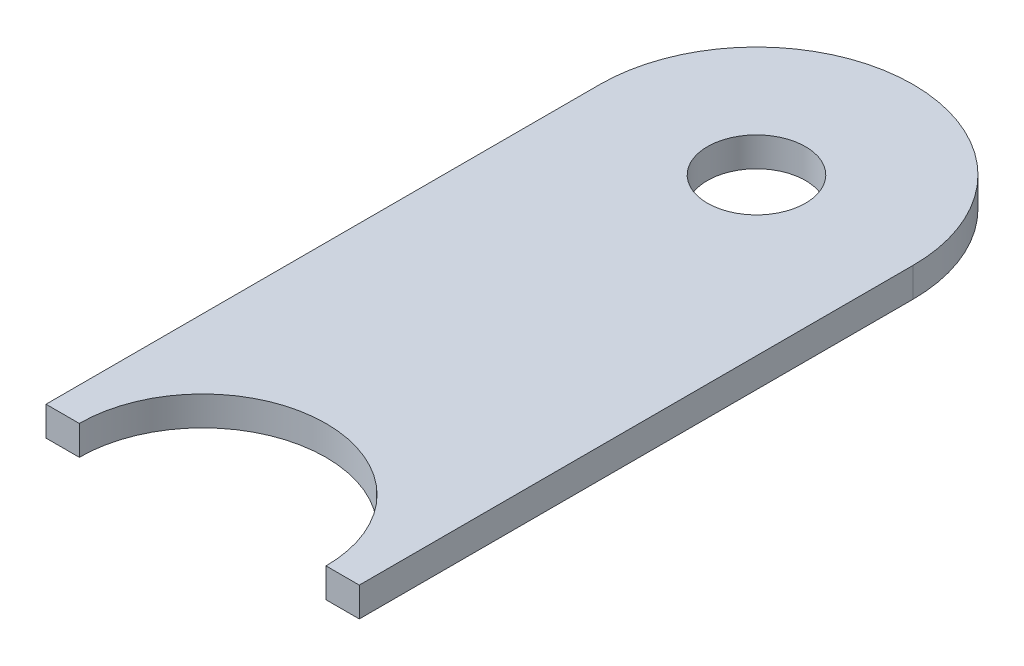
ISO-10303-21;
HEADER;
FILE_DESCRIPTION(('STEP AP214'),'2;1');
FILE_NAME('part.step','',(''),(''),'','','');
FILE_SCHEMA(('AUTOMOTIVE_DESIGN { 1 0 10303 214 1 1 1 1 }'));
ENDSEC;
DATA;
#1=APPLICATION_CONTEXT('core data for automotive mechanical design processes');
#2=APPLICATION_PROTOCOL_DEFINITION('international standard','automotive_design',2000,#1);
#3=PRODUCT_CONTEXT('',#1,'mechanical');
#4=PRODUCT('Part','Part','',(#3));
#5=PRODUCT_RELATED_PRODUCT_CATEGORY('part','',(#4));
#6=PRODUCT_DEFINITION_FORMATION('','',#4);
#7=PRODUCT_DEFINITION_CONTEXT('part definition',#1,'design');
#8=PRODUCT_DEFINITION('design','',#6,#7);
#9=PRODUCT_DEFINITION_SHAPE('','',#8);
#10=(LENGTH_UNIT() NAMED_UNIT(*) SI_UNIT(.MILLI.,.METRE.));
#11=(NAMED_UNIT(*) PLANE_ANGLE_UNIT() SI_UNIT($,.RADIAN.));
#12=(NAMED_UNIT(*) SI_UNIT($,.STERADIAN.) SOLID_ANGLE_UNIT());
#13=UNCERTAINTY_MEASURE_WITH_UNIT(LENGTH_MEASURE(1.E-05),#10,'distance_accuracy_value','');
#14=(GEOMETRIC_REPRESENTATION_CONTEXT(3) GLOBAL_UNCERTAINTY_ASSIGNED_CONTEXT((#13)) GLOBAL_UNIT_ASSIGNED_CONTEXT((#10,
#11,#12)) REPRESENTATION_CONTEXT('',''));
#15=CARTESIAN_POINT('',(0.,0.,0.));
#16=DIRECTION('',(0.,0.,1.));
#17=DIRECTION('',(1.,0.,0.));
#18=AXIS2_PLACEMENT_3D('',#15,#16,#17);
#19=CARTESIAN_POINT('',(16.,3.,0.));
#20=DIRECTION('',(0.,1.,0.));
#21=DIRECTION('',(0.,0.,1.));
#22=AXIS2_PLACEMENT_3D('',#19,#20,#21);
#23=PLANE('',#22);
#24=DIRECTION('',(1.,0.,0.));
#25=VECTOR('',#24,1.);
#26=CARTESIAN_POINT('',(0.,3.,0.));
#27=LINE('',#26,#25);
#28=CARTESIAN_POINT('',(0.,3.,0.));
#29=VERTEX_POINT('',#28);
#30=CARTESIAN_POINT('',(3.4,3.,0.));
#31=VERTEX_POINT('',#30);
#32=EDGE_CURVE('E152',#29,#31,#27,.T.);
#33=ORIENTED_EDGE('',*,*,#32,.T.);
#34=CARTESIAN_POINT('',(16.,3.,0.));
#35=DIRECTION('',(0.,-1.,0.));
#36=DIRECTION('',(0.,0.,1.));
#37=AXIS2_PLACEMENT_3D('',#34,#35,#36);
#38=CIRCLE('',#37,12.6);
#39=CARTESIAN_POINT('',(28.6,3.,0.));
#40=VERTEX_POINT('',#39);
#41=EDGE_CURVE('E100',#31,#40,#38,.T.);
#42=ORIENTED_EDGE('',*,*,#41,.T.);
#43=DIRECTION('',(1.,0.,0.));
#44=VECTOR('',#43,1.);
#45=CARTESIAN_POINT('',(28.6,3.,0.));
#46=LINE('',#45,#44);
#47=CARTESIAN_POINT('',(32.,3.,0.));
#48=VERTEX_POINT('',#47);
#49=EDGE_CURVE('E113',#40,#48,#46,.T.);
#50=ORIENTED_EDGE('',*,*,#49,.T.);
#51=DIRECTION('',(0.,0.,-1.));
#52=VECTOR('',#51,1.);
#53=CARTESIAN_POINT('',(32.,3.,0.));
#54=LINE('',#53,#52);
#55=CARTESIAN_POINT('',(32.,3.,-56.57));
#56=VERTEX_POINT('',#55);
#57=EDGE_CURVE('E107',#48,#56,#54,.T.);
#58=ORIENTED_EDGE('',*,*,#57,.T.);
#59=CARTESIAN_POINT('',(16.,3.,-56.57));
#60=DIRECTION('',(0.,1.,0.));
#61=DIRECTION('',(0.,0.,1.));
#62=AXIS2_PLACEMENT_3D('',#59,#60,#61);
#63=CIRCLE('',#62,16.);
#64=CARTESIAN_POINT('',(0.,3.,-56.57));
#65=VERTEX_POINT('',#64);
#66=EDGE_CURVE('E111',#56,#65,#63,.T.);
#67=ORIENTED_EDGE('',*,*,#66,.T.);
#68=DIRECTION('',(0.,0.,1.));
#69=VECTOR('',#68,1.);
#70=CARTESIAN_POINT('',(0.,3.,0.));
#71=LINE('',#70,#69);
#72=EDGE_CURVE('E63',#65,#29,#71,.T.);
#73=ORIENTED_EDGE('',*,*,#72,.T.);
#74=EDGE_LOOP('',(#33,#42,#50,#58,#67,#73));
#75=FACE_BOUND('',#74,.T.);
#76=CARTESIAN_POINT('',(16.,3.,-56.57));
#77=DIRECTION('',(0.,1.,0.));
#78=DIRECTION('',(0.,0.,1.));
#79=AXIS2_PLACEMENT_3D('',#76,#77,#78);
#80=CIRCLE('',#79,5.00842417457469);
#81=CARTESIAN_POINT('',(16.,3.,-51.5615758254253));
#82=VERTEX_POINT('',#81);
#83=EDGE_CURVE('E140',#82,#82,#80,.T.);
#84=ORIENTED_EDGE('',*,*,#83,.F.);
#85=EDGE_LOOP('',(#84));
#86=FACE_BOUND('',#85,.T.);
#87=ADVANCED_FACE('F45',(#75,#86),#23,.T.);
#88=CARTESIAN_POINT('',(16.,0.,0.));
#89=DIRECTION('',(0.,1.,0.));
#90=DIRECTION('',(0.,0.,1.));
#91=AXIS2_PLACEMENT_3D('',#88,#89,#90);
#92=PLANE('',#91);
#93=DIRECTION('',(1.,0.,0.));
#94=VECTOR('',#93,1.);
#95=CARTESIAN_POINT('',(0.,0.,0.));
#96=LINE('',#95,#94);
#97=CARTESIAN_POINT('',(0.,0.,0.));
#98=VERTEX_POINT('',#97);
#99=CARTESIAN_POINT('',(3.4,0.,0.));
#100=VERTEX_POINT('',#99);
#101=EDGE_CURVE('E135',#98,#100,#96,.T.);
#102=ORIENTED_EDGE('',*,*,#101,.F.);
#103=DIRECTION('',(0.,0.,1.));
#104=VECTOR('',#103,1.);
#105=CARTESIAN_POINT('',(0.,0.,0.));
#106=LINE('',#105,#104);
#107=CARTESIAN_POINT('',(0.,0.,-56.57));
#108=VERTEX_POINT('',#107);
#109=EDGE_CURVE('E92',#108,#98,#106,.T.);
#110=ORIENTED_EDGE('',*,*,#109,.F.);
#111=CARTESIAN_POINT('',(16.,0.,-56.57));
#112=DIRECTION('',(0.,1.,0.));
#113=DIRECTION('',(0.,0.,1.));
#114=AXIS2_PLACEMENT_3D('',#111,#112,#113);
#115=CIRCLE('',#114,16.);
#116=CARTESIAN_POINT('',(32.,0.,-56.57));
#117=VERTEX_POINT('',#116);
#118=EDGE_CURVE('E86',#117,#108,#115,.T.);
#119=ORIENTED_EDGE('',*,*,#118,.F.);
#120=DIRECTION('',(0.,0.,-1.));
#121=VECTOR('',#120,1.);
#122=CARTESIAN_POINT('',(32.,0.,0.));
#123=LINE('',#122,#121);
#124=CARTESIAN_POINT('',(32.,0.,0.));
#125=VERTEX_POINT('',#124);
#126=EDGE_CURVE('E122',#125,#117,#123,.T.);
#127=ORIENTED_EDGE('',*,*,#126,.F.);
#128=DIRECTION('',(1.,0.,0.));
#129=VECTOR('',#128,1.);
#130=CARTESIAN_POINT('',(28.6,0.,0.));
#131=LINE('',#130,#129);
#132=CARTESIAN_POINT('',(28.6,0.,0.));
#133=VERTEX_POINT('',#132);
#134=EDGE_CURVE('E143',#133,#125,#131,.T.);
#135=ORIENTED_EDGE('',*,*,#134,.F.);
#136=CARTESIAN_POINT('',(16.,0.,0.));
#137=DIRECTION('',(0.,-1.,0.));
#138=DIRECTION('',(0.,0.,1.));
#139=AXIS2_PLACEMENT_3D('',#136,#137,#138);
#140=CIRCLE('',#139,12.6);
#141=EDGE_CURVE('E139',#100,#133,#140,.T.);
#142=ORIENTED_EDGE('',*,*,#141,.F.);
#143=EDGE_LOOP('',(#102,#110,#119,#127,#135,#142));
#144=FACE_BOUND('',#143,.T.);
#145=CARTESIAN_POINT('',(16.,0.,-56.57));
#146=DIRECTION('',(0.,1.,0.));
#147=DIRECTION('',(0.,0.,1.));
#148=AXIS2_PLACEMENT_3D('',#145,#146,#147);
#149=CIRCLE('',#148,5.00842417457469);
#150=CARTESIAN_POINT('',(16.,0.,-51.5615758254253));
#151=VERTEX_POINT('',#150);
#152=EDGE_CURVE('E249',#151,#151,#149,.T.);
#153=ORIENTED_EDGE('',*,*,#152,.T.);
#154=EDGE_LOOP('',(#153));
#155=FACE_BOUND('',#154,.T.);
#156=ADVANCED_FACE('F165',(#144,#155),#92,.F.);
#157=CARTESIAN_POINT('',(0.,3.,0.));
#158=DIRECTION('',(0.,0.,-1.));
#159=DIRECTION('',(-1.,0.,0.));
#160=AXIS2_PLACEMENT_3D('',#157,#158,#159);
#161=PLANE('',#160);
#162=ORIENTED_EDGE('',*,*,#101,.T.);
#163=DIRECTION('',(0.,-1.,0.));
#164=VECTOR('',#163,1.);
#165=CARTESIAN_POINT('',(3.4,3.,0.));
#166=LINE('',#165,#164);
#167=EDGE_CURVE('E11',#31,#100,#166,.T.);
#168=ORIENTED_EDGE('',*,*,#167,.F.);
#169=ORIENTED_EDGE('',*,*,#32,.F.);
#170=DIRECTION('',(0.,-1.,0.));
#171=VECTOR('',#170,1.);
#172=CARTESIAN_POINT('',(0.,3.,0.));
#173=LINE('',#172,#171);
#174=EDGE_CURVE('E131',#29,#98,#173,.T.);
#175=ORIENTED_EDGE('',*,*,#174,.T.);
#176=EDGE_LOOP('',(#162,#168,#169,#175));
#177=FACE_BOUND('',#176,.T.);
#178=ADVANCED_FACE('F47',(#177),#161,.F.);
#179=CARTESIAN_POINT('',(16.,3.,0.));
#180=DIRECTION('',(0.,-1.,0.));
#181=DIRECTION('',(0.,0.,-1.));
#182=AXIS2_PLACEMENT_3D('',#179,#180,#181);
#183=CYLINDRICAL_SURFACE('',#182,12.6);
#184=ORIENTED_EDGE('',*,*,#141,.T.);
#185=DIRECTION('',(0.,-1.,0.));
#186=VECTOR('',#185,1.);
#187=CARTESIAN_POINT('',(28.6,3.,0.));
#188=LINE('',#187,#186);
#189=EDGE_CURVE('E55',#40,#133,#188,.T.);
#190=ORIENTED_EDGE('',*,*,#189,.F.);
#191=ORIENTED_EDGE('',*,*,#41,.F.);
#192=ORIENTED_EDGE('',*,*,#167,.T.);
#193=EDGE_LOOP('',(#184,#190,#191,#192));
#194=FACE_BOUND('',#193,.T.);
#195=ADVANCED_FACE('F190',(#194),#183,.F.);
#196=CARTESIAN_POINT('',(28.6,3.,0.));
#197=DIRECTION('',(0.,0.,-1.));
#198=DIRECTION('',(-1.,0.,0.));
#199=AXIS2_PLACEMENT_3D('',#196,#197,#198);
#200=PLANE('',#199);
#201=ORIENTED_EDGE('',*,*,#134,.T.);
#202=DIRECTION('',(0.,-1.,0.));
#203=VECTOR('',#202,1.);
#204=CARTESIAN_POINT('',(32.,3.,0.));
#205=LINE('',#204,#203);
#206=EDGE_CURVE('E124',#48,#125,#205,.T.);
#207=ORIENTED_EDGE('',*,*,#206,.F.);
#208=ORIENTED_EDGE('',*,*,#49,.F.);
#209=ORIENTED_EDGE('',*,*,#189,.T.);
#210=EDGE_LOOP('',(#201,#207,#208,#209));
#211=FACE_BOUND('',#210,.T.);
#212=ADVANCED_FACE('F162',(#211),#200,.F.);
#213=CARTESIAN_POINT('',(32.,3.,0.));
#214=DIRECTION('',(-1.,0.,0.));
#215=DIRECTION('',(0.,0.,1.));
#216=AXIS2_PLACEMENT_3D('',#213,#214,#215);
#217=PLANE('',#216);
#218=ORIENTED_EDGE('',*,*,#126,.T.);
#219=DIRECTION('',(0.,-1.,0.));
#220=VECTOR('',#219,1.);
#221=CARTESIAN_POINT('',(32.,3.,-56.57));
#222=LINE('',#221,#220);
#223=EDGE_CURVE('E119',#56,#117,#222,.T.);
#224=ORIENTED_EDGE('',*,*,#223,.F.);
#225=ORIENTED_EDGE('',*,*,#57,.F.);
#226=ORIENTED_EDGE('',*,*,#206,.T.);
#227=EDGE_LOOP('',(#218,#224,#225,#226));
#228=FACE_BOUND('',#227,.T.);
#229=ADVANCED_FACE('F120',(#228),#217,.F.);
#230=CARTESIAN_POINT('',(16.,3.,-56.57));
#231=DIRECTION('',(0.,-1.,0.));
#232=DIRECTION('',(0.,0.,-1.));
#233=AXIS2_PLACEMENT_3D('',#230,#231,#232);
#234=CYLINDRICAL_SURFACE('',#233,16.);
#235=ORIENTED_EDGE('',*,*,#118,.T.);
#236=DIRECTION('',(0.,-1.,0.));
#237=VECTOR('',#236,1.);
#238=CARTESIAN_POINT('',(0.,3.,-56.57));
#239=LINE('',#238,#237);
#240=EDGE_CURVE('E125',#65,#108,#239,.T.);
#241=ORIENTED_EDGE('',*,*,#240,.F.);
#242=ORIENTED_EDGE('',*,*,#66,.F.);
#243=ORIENTED_EDGE('',*,*,#223,.T.);
#244=EDGE_LOOP('',(#235,#241,#242,#243));
#245=FACE_BOUND('',#244,.T.);
#246=ADVANCED_FACE('F127',(#245),#234,.T.);
#247=CARTESIAN_POINT('',(0.,3.,0.));
#248=DIRECTION('',(1.,0.,0.));
#249=DIRECTION('',(0.,0.,-1.));
#250=AXIS2_PLACEMENT_3D('',#247,#248,#249);
#251=PLANE('',#250);
#252=ORIENTED_EDGE('',*,*,#109,.T.);
#253=ORIENTED_EDGE('',*,*,#174,.F.);
#254=ORIENTED_EDGE('',*,*,#72,.F.);
#255=ORIENTED_EDGE('',*,*,#240,.T.);
#256=EDGE_LOOP('',(#252,#253,#254,#255));
#257=FACE_BOUND('',#256,.T.);
#258=ADVANCED_FACE('F170',(#257),#251,.F.);
#259=CARTESIAN_POINT('',(16.,3.,-56.57));
#260=DIRECTION('',(0.,-1.,0.));
#261=DIRECTION('',(0.,0.,-1.));
#262=AXIS2_PLACEMENT_3D('',#259,#260,#261);
#263=CYLINDRICAL_SURFACE('',#262,5.00842417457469);
#264=ORIENTED_EDGE('',*,*,#83,.T.);
#265=EDGE_LOOP('',(#264));
#266=FACE_BOUND('',#265,.T.);
#267=ORIENTED_EDGE('',*,*,#152,.F.);
#268=EDGE_LOOP('',(#267));
#269=FACE_BOUND('',#268,.T.);
#270=ADVANCED_FACE('F172',(#266,#269),#263,.F.);
#271=CLOSED_SHELL('',(#87,#156,#178,#195,#212,#229,#246,#258,#270));
#272=MANIFOLD_SOLID_BREP('B2',#271);
#273=ADVANCED_BREP_SHAPE_REPRESENTATION('',(#18,#272),#14);
#274=SHAPE_DEFINITION_REPRESENTATION(#9,#273);
ENDSEC;
END-ISO-10303-21;
